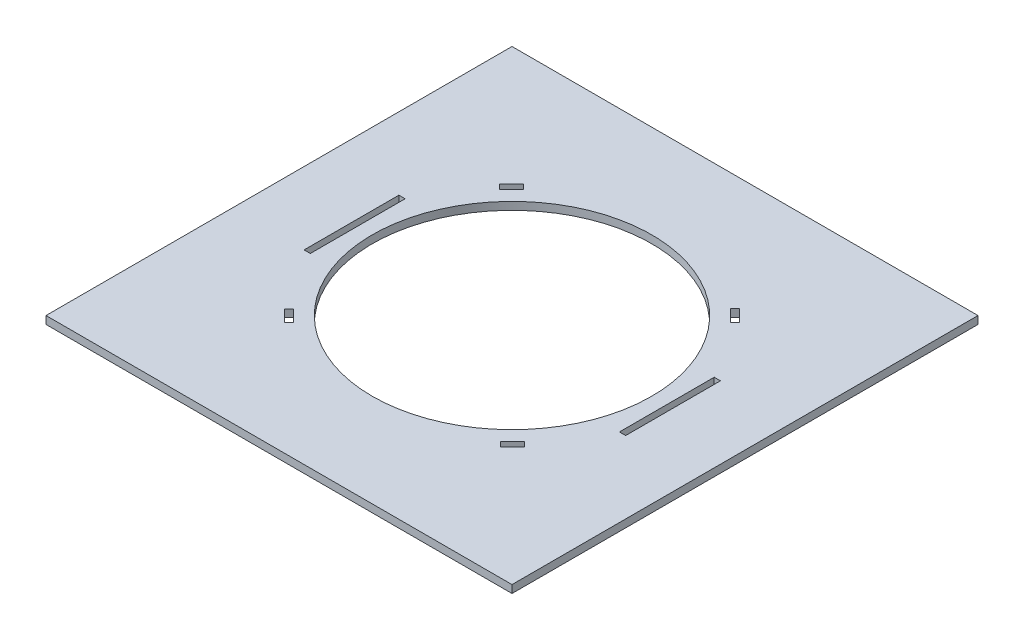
ISO-10303-21;
HEADER;
FILE_DESCRIPTION(('STEP AP214'),'2;1');
FILE_NAME('part.step','',(''),(''),'','','');
FILE_SCHEMA(('AUTOMOTIVE_DESIGN { 1 0 10303 214 1 1 1 1 }'));
ENDSEC;
DATA;
#1=APPLICATION_CONTEXT('core data for automotive mechanical design processes');
#2=APPLICATION_PROTOCOL_DEFINITION('international standard','automotive_design',2000,#1);
#3=PRODUCT_CONTEXT('',#1,'mechanical');
#4=PRODUCT('Part','Part','',(#3));
#5=PRODUCT_RELATED_PRODUCT_CATEGORY('part','',(#4));
#6=PRODUCT_DEFINITION_FORMATION('','',#4);
#7=PRODUCT_DEFINITION_CONTEXT('part definition',#1,'design');
#8=PRODUCT_DEFINITION('design','',#6,#7);
#9=PRODUCT_DEFINITION_SHAPE('','',#8);
#10=(LENGTH_UNIT() NAMED_UNIT(*) SI_UNIT(.MILLI.,.METRE.));
#11=(NAMED_UNIT(*) PLANE_ANGLE_UNIT() SI_UNIT($,.RADIAN.));
#12=(NAMED_UNIT(*) SI_UNIT($,.STERADIAN.) SOLID_ANGLE_UNIT());
#13=UNCERTAINTY_MEASURE_WITH_UNIT(LENGTH_MEASURE(1.E-05),#10,'distance_accuracy_value','');
#14=(GEOMETRIC_REPRESENTATION_CONTEXT(3) GLOBAL_UNCERTAINTY_ASSIGNED_CONTEXT((#13)) GLOBAL_UNIT_ASSIGNED_CONTEXT((#10,
#11,#12)) REPRESENTATION_CONTEXT('',''));
#15=CARTESIAN_POINT('',(0.,0.,0.));
#16=DIRECTION('',(0.,0.,1.));
#17=DIRECTION('',(1.,0.,0.));
#18=AXIS2_PLACEMENT_3D('',#15,#16,#17);
#19=CARTESIAN_POINT('',(0.,5.,0.));
#20=DIRECTION('',(0.,1.,0.));
#21=DIRECTION('',(0.,0.,1.));
#22=AXIS2_PLACEMENT_3D('',#19,#20,#21);
#23=PLANE('',#22);
#24=CARTESIAN_POINT('',(-77.2123238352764,5.,-69.1700935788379));
#25=CARTESIAN_POINT('',(-74.3725830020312,5.,-66.3303527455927));
#26=B_SPLINE_CURVE_WITH_KNOTS('',1,(#24,#25),.UNSPECIFIED.,.F.,.F.,(2,2),(0.,0.133581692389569),.UNSPECIFIED.);
#27=CARTESIAN_POINT('',(-77.2123238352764,5.,-69.1700935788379));
#28=VERTEX_POINT('',#27);
#29=CARTESIAN_POINT('',(-74.3725830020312,5.,-66.3303527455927));
#30=VERTEX_POINT('',#29);
#31=EDGE_CURVE('E277',#28,#30,#26,.T.);
#32=ORIENTED_EDGE('',*,*,#31,.F.);
#33=CARTESIAN_POINT('',(-69.4228355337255,5.,-76.9595818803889));
#34=CARTESIAN_POINT('',(-77.2123238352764,5.,-69.1700935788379));
#35=B_SPLINE_CURVE_WITH_KNOTS('',1,(#33,#34),.UNSPECIFIED.,.F.,.F.,(2,2),(0.633581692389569,1.),.UNSPECIFIED.);
#36=CARTESIAN_POINT('',(-69.4228355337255,5.,-76.9595818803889));
#37=VERTEX_POINT('',#36);
#38=EDGE_CURVE('E350',#37,#28,#35,.T.);
#39=ORIENTED_EDGE('',*,*,#38,.F.);
#40=CARTESIAN_POINT('',(-66.5830947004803,5.,-74.1198410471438));
#41=CARTESIAN_POINT('',(-69.4228355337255,5.,-76.9595818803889));
#42=B_SPLINE_CURVE_WITH_KNOTS('',1,(#40,#41),.UNSPECIFIED.,.F.,.F.,(2,2),(0.5,
0.633581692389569),.UNSPECIFIED.);
#43=CARTESIAN_POINT('',(-66.5830947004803,5.,-74.1198410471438));
#44=VERTEX_POINT('',#43);
#45=EDGE_CURVE('E342',#44,#37,#42,.T.);
#46=ORIENTED_EDGE('',*,*,#45,.F.);
#47=CARTESIAN_POINT('',(-74.3725830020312,5.,-66.3303527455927));
#48=CARTESIAN_POINT('',(-66.5830947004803,5.,-74.1198410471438));
#49=B_SPLINE_CURVE_WITH_KNOTS('',1,(#47,#48),.UNSPECIFIED.,.F.,.F.,(2,2),(0.133581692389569,
0.5),.UNSPECIFIED.);
#50=EDGE_CURVE('E334',#30,#44,#49,.T.);
#51=ORIENTED_EDGE('',*,*,#50,.F.);
#52=EDGE_LOOP('',(#32,#39,#46,#51));
#53=FACE_BOUND('',#52,.T.);
#54=CARTESIAN_POINT('',(69.1700935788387,5.,-77.2123238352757));
#55=CARTESIAN_POINT('',(66.3303527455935,5.,-74.3725830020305));
#56=B_SPLINE_CURVE_WITH_KNOTS('',1,(#54,#55),.UNSPECIFIED.,.F.,.F.,(2,2),(0.,0.133581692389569),.UNSPECIFIED.);
#57=CARTESIAN_POINT('',(69.1700935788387,5.,-77.2123238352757));
#58=VERTEX_POINT('',#57);
#59=CARTESIAN_POINT('',(66.3303527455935,5.,-74.3725830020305));
#60=VERTEX_POINT('',#59);
#61=EDGE_CURVE('E370',#58,#60,#56,.T.);
#62=ORIENTED_EDGE('',*,*,#61,.F.);
#63=CARTESIAN_POINT('',(76.9595818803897,5.,-69.4228355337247));
#64=CARTESIAN_POINT('',(69.1700935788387,5.,-77.2123238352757));
#65=B_SPLINE_CURVE_WITH_KNOTS('',1,(#63,#64),.UNSPECIFIED.,.F.,.F.,(2,2),(0.633581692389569,1.),.UNSPECIFIED.);
#66=CARTESIAN_POINT('',(76.9595818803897,5.,-69.4228355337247));
#67=VERTEX_POINT('',#66);
#68=EDGE_CURVE('E399',#67,#58,#65,.T.);
#69=ORIENTED_EDGE('',*,*,#68,.F.);
#70=CARTESIAN_POINT('',(74.1198410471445,5.,-66.5830947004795));
#71=CARTESIAN_POINT('',(76.9595818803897,5.,-69.4228355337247));
#72=B_SPLINE_CURVE_WITH_KNOTS('',1,(#70,#71),.UNSPECIFIED.,.F.,.F.,(2,2),(0.5,
0.633581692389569),.UNSPECIFIED.);
#73=CARTESIAN_POINT('',(74.1198410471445,5.,-66.5830947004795));
#74=VERTEX_POINT('',#73);
#75=EDGE_CURVE('E391',#74,#67,#72,.T.);
#76=ORIENTED_EDGE('',*,*,#75,.F.);
#77=CARTESIAN_POINT('',(66.3303527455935,5.,-74.3725830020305));
#78=CARTESIAN_POINT('',(74.1198410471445,5.,-66.5830947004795));
#79=B_SPLINE_CURVE_WITH_KNOTS('',1,(#77,#78),.UNSPECIFIED.,.F.,.F.,(2,2),(0.133581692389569,
0.5),.UNSPECIFIED.);
#80=EDGE_CURVE('E383',#60,#74,#79,.T.);
#81=ORIENTED_EDGE('',*,*,#80,.F.);
#82=EDGE_LOOP('',(#62,#69,#76,#81));
#83=FACE_BOUND('',#82,.T.);
#84=CARTESIAN_POINT('',(77.2123238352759,5.,69.1700935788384));
#85=CARTESIAN_POINT('',(74.3725830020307,5.,66.3303527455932));
#86=B_SPLINE_CURVE_WITH_KNOTS('',1,(#84,#85),.UNSPECIFIED.,.F.,.F.,(2,2),(0.,0.133581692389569),.UNSPECIFIED.);
#87=CARTESIAN_POINT('',(77.2123238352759,5.,69.1700935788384));
#88=VERTEX_POINT('',#87);
#89=CARTESIAN_POINT('',(74.3725830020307,5.,66.3303527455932));
#90=VERTEX_POINT('',#89);
#91=EDGE_CURVE('E419',#88,#90,#86,.T.);
#92=ORIENTED_EDGE('',*,*,#91,.F.);
#93=CARTESIAN_POINT('',(69.4228355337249,5.,76.9595818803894));
#94=CARTESIAN_POINT('',(77.2123238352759,5.,69.1700935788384));
#95=B_SPLINE_CURVE_WITH_KNOTS('',1,(#93,#94),.UNSPECIFIED.,.F.,.F.,(2,2),(0.633581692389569,1.),.UNSPECIFIED.);
#96=CARTESIAN_POINT('',(69.4228355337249,5.,76.9595818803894));
#97=VERTEX_POINT('',#96);
#98=EDGE_CURVE('E448',#97,#88,#95,.T.);
#99=ORIENTED_EDGE('',*,*,#98,.F.);
#100=CARTESIAN_POINT('',(66.5830947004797,5.,74.1198410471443));
#101=CARTESIAN_POINT('',(69.4228355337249,5.,76.9595818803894));
#102=B_SPLINE_CURVE_WITH_KNOTS('',1,(#100,#101),.UNSPECIFIED.,.F.,.F.,(2,2),(0.5,
0.633581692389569),.UNSPECIFIED.);
#103=CARTESIAN_POINT('',(66.5830947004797,5.,74.1198410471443));
#104=VERTEX_POINT('',#103);
#105=EDGE_CURVE('E440',#104,#97,#102,.T.);
#106=ORIENTED_EDGE('',*,*,#105,.F.);
#107=CARTESIAN_POINT('',(74.3725830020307,5.,66.3303527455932));
#108=CARTESIAN_POINT('',(66.5830947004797,5.,74.1198410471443));
#109=B_SPLINE_CURVE_WITH_KNOTS('',1,(#107,#108),.UNSPECIFIED.,.F.,.F.,(2,2),(0.133581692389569,
0.5),.UNSPECIFIED.);
#110=EDGE_CURVE('E432',#90,#104,#109,.T.);
#111=ORIENTED_EDGE('',*,*,#110,.F.);
#112=EDGE_LOOP('',(#92,#99,#106,#111));
#113=FACE_BOUND('',#112,.T.);
#114=CARTESIAN_POINT('',(-69.1700935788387,5.,77.2123238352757));
#115=CARTESIAN_POINT('',(-66.3303527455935,5.,74.3725830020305));
#116=B_SPLINE_CURVE_WITH_KNOTS('',1,(#114,#115),.UNSPECIFIED.,.F.,.F.,(2,2),(0.,
0.133581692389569),.UNSPECIFIED.);
#117=CARTESIAN_POINT('',(-69.1700935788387,5.,77.2123238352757));
#118=VERTEX_POINT('',#117);
#119=CARTESIAN_POINT('',(-66.3303527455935,5.,74.3725830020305));
#120=VERTEX_POINT('',#119);
#121=EDGE_CURVE('E468',#118,#120,#116,.T.);
#122=ORIENTED_EDGE('',*,*,#121,.F.);
#123=CARTESIAN_POINT('',(-76.9595818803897,5.,69.4228355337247));
#124=CARTESIAN_POINT('',(-69.1700935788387,5.,77.2123238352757));
#125=B_SPLINE_CURVE_WITH_KNOTS('',1,(#123,#124),.UNSPECIFIED.,.F.,.F.,(2,2),(0.633581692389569,
1.),.UNSPECIFIED.);
#126=CARTESIAN_POINT('',(-76.9595818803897,5.,69.4228355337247));
#127=VERTEX_POINT('',#126);
#128=EDGE_CURVE('E497',#127,#118,#125,.T.);
#129=ORIENTED_EDGE('',*,*,#128,.F.);
#130=CARTESIAN_POINT('',(-74.1198410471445,5.,66.5830947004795));
#131=CARTESIAN_POINT('',(-76.9595818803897,5.,69.4228355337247));
#132=B_SPLINE_CURVE_WITH_KNOTS('',1,(#130,#131),.UNSPECIFIED.,.F.,.F.,(2,2),(0.5,
0.633581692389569),.UNSPECIFIED.);
#133=CARTESIAN_POINT('',(-74.1198410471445,5.,66.5830947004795));
#134=VERTEX_POINT('',#133);
#135=EDGE_CURVE('E489',#134,#127,#132,.T.);
#136=ORIENTED_EDGE('',*,*,#135,.F.);
#137=CARTESIAN_POINT('',(-66.3303527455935,5.,74.3725830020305));
#138=CARTESIAN_POINT('',(-74.1198410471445,5.,66.5830947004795));
#139=B_SPLINE_CURVE_WITH_KNOTS('',1,(#137,#138),.UNSPECIFIED.,.F.,.F.,(2,2),(0.133581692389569,
0.5),.UNSPECIFIED.);
#140=EDGE_CURVE('E481',#120,#134,#139,.T.);
#141=ORIENTED_EDGE('',*,*,#140,.F.);
#142=EDGE_LOOP('',(#122,#129,#136,#141));
#143=FACE_BOUND('',#142,.T.);
#144=DIRECTION('',(0.,0.,1.));
#145=VECTOR('',#144,1.);
#146=CARTESIAN_POINT('',(-150.,5.,-150.));
#147=LINE('',#146,#145);
#148=CARTESIAN_POINT('',(-150.,5.,-150.));
#149=VERTEX_POINT('',#148);
#150=CARTESIAN_POINT('',(-150.,5.,150.));
#151=VERTEX_POINT('',#150);
#152=EDGE_CURVE('E524',#149,#151,#147,.T.);
#153=ORIENTED_EDGE('',*,*,#152,.T.);
#154=DIRECTION('',(1.,0.,0.));
#155=VECTOR('',#154,1.);
#156=CARTESIAN_POINT('',(-150.,5.,150.));
#157=LINE('',#156,#155);
#158=CARTESIAN_POINT('',(150.,5.,150.));
#159=VERTEX_POINT('',#158);
#160=EDGE_CURVE('E527',#151,#159,#157,.T.);
#161=ORIENTED_EDGE('',*,*,#160,.T.);
#162=DIRECTION('',(0.,0.,-1.));
#163=VECTOR('',#162,1.);
#164=CARTESIAN_POINT('',(150.,5.,-150.));
#165=LINE('',#164,#163);
#166=CARTESIAN_POINT('',(150.,5.,-150.));
#167=VERTEX_POINT('',#166);
#168=EDGE_CURVE('E530',#159,#167,#165,.T.);
#169=ORIENTED_EDGE('',*,*,#168,.T.);
#170=DIRECTION('',(-1.,0.,0.));
#171=VECTOR('',#170,1.);
#172=CARTESIAN_POINT('',(-150.,5.,-150.));
#173=LINE('',#172,#171);
#174=EDGE_CURVE('E532',#167,#149,#173,.T.);
#175=ORIENTED_EDGE('',*,*,#174,.T.);
#176=EDGE_LOOP('',(#153,#161,#169,#175));
#177=FACE_BOUND('',#176,.T.);
#178=CARTESIAN_POINT('',(0.,5.,0.));
#179=DIRECTION('',(0.,1.,0.));
#180=DIRECTION('',(0.,0.,1.));
#181=AXIS2_PLACEMENT_3D('',#178,#179,#180);
#182=CIRCLE('',#181,90.);
#183=CARTESIAN_POINT('',(0.,5.,90.));
#184=VERTEX_POINT('',#183);
#185=EDGE_CURVE('E518',#184,#184,#182,.T.);
#186=ORIENTED_EDGE('',*,*,#185,.F.);
#187=EDGE_LOOP('',(#186));
#188=FACE_BOUND('',#187,.T.);
#189=CARTESIAN_POINT('',(-99.492,5.,30.3292844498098));
#190=CARTESIAN_POINT('',(-103.508,5.,30.3292844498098));
#191=B_SPLINE_CURVE_WITH_KNOTS('',1,(#189,#190),.UNSPECIFIED.,.F.,.F.,(2,2),(0.5,
0.530877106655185),.UNSPECIFIED.);
#192=CARTESIAN_POINT('',(-99.492,5.,30.3292844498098));
#193=VERTEX_POINT('',#192);
#194=CARTESIAN_POINT('',(-103.508,5.,30.3292844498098));
#195=VERTEX_POINT('',#194);
#196=EDGE_CURVE('E292',#193,#195,#191,.T.);
#197=ORIENTED_EDGE('',*,*,#196,.T.);
#198=CARTESIAN_POINT('',(-103.508,5.,30.3292844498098));
#199=CARTESIAN_POINT('',(-103.508,5.,-30.6867155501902));
#200=B_SPLINE_CURVE_WITH_KNOTS('',1,(#198,#199),.UNSPECIFIED.,.F.,.F.,(2,2),(0.530877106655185,
1.),.UNSPECIFIED.);
#201=CARTESIAN_POINT('',(-103.508,5.,-30.6867155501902));
#202=VERTEX_POINT('',#201);
#203=EDGE_CURVE('E300',#195,#202,#200,.T.);
#204=ORIENTED_EDGE('',*,*,#203,.T.);
#205=CARTESIAN_POINT('',(-103.508,5.,-30.6867155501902));
#206=CARTESIAN_POINT('',(-99.492,5.,-30.6867155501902));
#207=B_SPLINE_CURVE_WITH_KNOTS('',1,(#205,#206),.UNSPECIFIED.,.F.,.F.,(2,2),(0.,
0.0308771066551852),.UNSPECIFIED.);
#208=CARTESIAN_POINT('',(-99.492,5.,-30.6867155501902));
#209=VERTEX_POINT('',#208);
#210=EDGE_CURVE('E278',#202,#209,#207,.T.);
#211=ORIENTED_EDGE('',*,*,#210,.T.);
#212=CARTESIAN_POINT('',(-99.492,5.,-30.6867155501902));
#213=CARTESIAN_POINT('',(-99.492,5.,30.3292844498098));
#214=B_SPLINE_CURVE_WITH_KNOTS('',1,(#212,#213),.UNSPECIFIED.,.F.,.F.,(2,2),(0.0308771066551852,
0.5),.UNSPECIFIED.);
#215=EDGE_CURVE('E283',#209,#193,#214,.T.);
#216=ORIENTED_EDGE('',*,*,#215,.T.);
#217=EDGE_LOOP('',(#197,#204,#211,#216));
#218=FACE_BOUND('',#217,.T.);
#219=CARTESIAN_POINT('',(103.508,5.,-30.6867155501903));
#220=CARTESIAN_POINT('',(99.492,5.,-30.6867155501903));
#221=B_SPLINE_CURVE_WITH_KNOTS('',1,(#219,#220),.UNSPECIFIED.,.F.,.F.,(2,2),(0.,
0.0308771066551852),.UNSPECIFIED.);
#222=CARTESIAN_POINT('',(103.508,5.,-30.6867155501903));
#223=VERTEX_POINT('',#222);
#224=CARTESIAN_POINT('',(99.492,5.,-30.6867155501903));
#225=VERTEX_POINT('',#224);
#226=EDGE_CURVE('E232',#223,#225,#221,.T.);
#227=ORIENTED_EDGE('',*,*,#226,.F.);
#228=CARTESIAN_POINT('',(103.508,5.,30.3292844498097));
#229=CARTESIAN_POINT('',(103.508,5.,-30.6867155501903));
#230=B_SPLINE_CURVE_WITH_KNOTS('',1,(#228,#229),.UNSPECIFIED.,.F.,.F.,(2,2),(0.530877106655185,
1.),.UNSPECIFIED.);
#231=CARTESIAN_POINT('',(103.508,5.,30.3292844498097));
#232=VERTEX_POINT('',#231);
#233=EDGE_CURVE('E50',#232,#223,#230,.T.);
#234=ORIENTED_EDGE('',*,*,#233,.F.);
#235=CARTESIAN_POINT('',(99.492,5.,30.3292844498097));
#236=CARTESIAN_POINT('',(103.508,5.,30.3292844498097));
#237=B_SPLINE_CURVE_WITH_KNOTS('',1,(#235,#236),.UNSPECIFIED.,.F.,.F.,(2,2),(0.5,
0.530877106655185),.UNSPECIFIED.);
#238=CARTESIAN_POINT('',(99.492,5.,30.3292844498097));
#239=VERTEX_POINT('',#238);
#240=EDGE_CURVE('E238',#239,#232,#237,.T.);
#241=ORIENTED_EDGE('',*,*,#240,.F.);
#242=CARTESIAN_POINT('',(99.492,5.,-30.6867155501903));
#243=CARTESIAN_POINT('',(99.492,5.,30.3292844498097));
#244=B_SPLINE_CURVE_WITH_KNOTS('',1,(#242,#243),.UNSPECIFIED.,.F.,.F.,(2,2),(0.0308771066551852,
0.5),.UNSPECIFIED.);
#245=EDGE_CURVE('E223',#225,#239,#244,.T.);
#246=ORIENTED_EDGE('',*,*,#245,.F.);
#247=EDGE_LOOP('',(#227,#234,#241,#246));
#248=FACE_BOUND('',#247,.T.);
#249=ADVANCED_FACE('F35',(#53,#83,#113,#143,#177,#188,#218,#248),#23,.T.);
#250=CARTESIAN_POINT('',(0.,0.,0.));
#251=DIRECTION('',(0.,1.,0.));
#252=DIRECTION('',(0.,0.,1.));
#253=AXIS2_PLACEMENT_3D('',#250,#251,#252);
#254=PLANE('',#253);
#255=DIRECTION('',(0.,0.,1.));
#256=VECTOR('',#255,1.);
#257=CARTESIAN_POINT('',(-103.508,0.,30.3292844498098));
#258=LINE('',#257,#256);
#259=CARTESIAN_POINT('',(-103.508,0.,-30.6867155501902));
#260=VERTEX_POINT('',#259);
#261=CARTESIAN_POINT('',(-103.508,0.,30.3292844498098));
#262=VERTEX_POINT('',#261);
#263=EDGE_CURVE('E271',#260,#262,#258,.T.);
#264=ORIENTED_EDGE('',*,*,#263,.T.);
#265=DIRECTION('',(1.,0.,0.));
#266=VECTOR('',#265,1.);
#267=CARTESIAN_POINT('',(-99.492,0.,30.3292844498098));
#268=LINE('',#267,#266);
#269=CARTESIAN_POINT('',(-99.492,0.,30.3292844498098));
#270=VERTEX_POINT('',#269);
#271=EDGE_CURVE('E267',#262,#270,#268,.T.);
#272=ORIENTED_EDGE('',*,*,#271,.T.);
#273=DIRECTION('',(0.,0.,-1.));
#274=VECTOR('',#273,1.);
#275=CARTESIAN_POINT('',(-99.492,0.,-30.6867155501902));
#276=LINE('',#275,#274);
#277=CARTESIAN_POINT('',(-99.492,0.,-30.6867155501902));
#278=VERTEX_POINT('',#277);
#279=EDGE_CURVE('E270',#270,#278,#276,.T.);
#280=ORIENTED_EDGE('',*,*,#279,.T.);
#281=DIRECTION('',(-1.,0.,0.));
#282=VECTOR('',#281,1.);
#283=CARTESIAN_POINT('',(-103.508,0.,-30.6867155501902));
#284=LINE('',#283,#282);
#285=EDGE_CURVE('E274',#278,#260,#284,.T.);
#286=ORIENTED_EDGE('',*,*,#285,.T.);
#287=EDGE_LOOP('',(#264,#272,#280,#286));
#288=FACE_BOUND('',#287,.T.);
#289=DIRECTION('',(0.70710678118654,0.,-0.707106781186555));
#290=VECTOR('',#289,1.);
#291=CARTESIAN_POINT('',(-69.4228355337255,0.,-76.9595818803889));
#292=LINE('',#291,#290);
#293=CARTESIAN_POINT('',(-77.2123238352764,0.,-69.1700935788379));
#294=VERTEX_POINT('',#293);
#295=CARTESIAN_POINT('',(-69.4228355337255,0.,-76.9595818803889));
#296=VERTEX_POINT('',#295);
#297=EDGE_CURVE('E325',#294,#296,#292,.T.);
#298=ORIENTED_EDGE('',*,*,#297,.F.);
#299=DIRECTION('',(-0.707106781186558,0.,-0.707106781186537));
#300=VECTOR('',#299,1.);
#301=CARTESIAN_POINT('',(-77.2123238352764,0.,-69.1700935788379));
#302=LINE('',#301,#300);
#303=CARTESIAN_POINT('',(-74.3725830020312,0.,-66.3303527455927));
#304=VERTEX_POINT('',#303);
#305=EDGE_CURVE('E328',#304,#294,#302,.T.);
#306=ORIENTED_EDGE('',*,*,#305,.F.);
#307=DIRECTION('',(-0.70710678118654,0.,0.707106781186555));
#308=VECTOR('',#307,1.);
#309=CARTESIAN_POINT('',(-74.3725830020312,0.,-66.3303527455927));
#310=LINE('',#309,#308);
#311=CARTESIAN_POINT('',(-66.5830947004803,0.,-74.1198410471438));
#312=VERTEX_POINT('',#311);
#313=EDGE_CURVE('E330',#312,#304,#310,.T.);
#314=ORIENTED_EDGE('',*,*,#313,.F.);
#315=DIRECTION('',(0.707106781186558,0.,0.707106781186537));
#316=VECTOR('',#315,1.);
#317=CARTESIAN_POINT('',(-66.5830947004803,0.,-74.1198410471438));
#318=LINE('',#317,#316);
#319=EDGE_CURVE('E322',#296,#312,#318,.T.);
#320=ORIENTED_EDGE('',*,*,#319,.F.);
#321=EDGE_LOOP('',(#298,#306,#314,#320));
#322=FACE_BOUND('',#321,.T.);
#323=DIRECTION('',(0.707106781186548,0.,0.707106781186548));
#324=VECTOR('',#323,1.);
#325=CARTESIAN_POINT('',(76.9595818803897,0.,-69.4228355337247));
#326=LINE('',#325,#324);
#327=CARTESIAN_POINT('',(69.1700935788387,0.,-77.2123238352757));
#328=VERTEX_POINT('',#327);
#329=CARTESIAN_POINT('',(76.9595818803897,0.,-69.4228355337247));
#330=VERTEX_POINT('',#329);
#331=EDGE_CURVE('E374',#328,#330,#326,.T.);
#332=ORIENTED_EDGE('',*,*,#331,.F.);
#333=DIRECTION('',(0.707106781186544,0.,-0.707106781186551));
#334=VECTOR('',#333,1.);
#335=CARTESIAN_POINT('',(69.1700935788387,0.,-77.2123238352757));
#336=LINE('',#335,#334);
#337=CARTESIAN_POINT('',(66.3303527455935,0.,-74.3725830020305));
#338=VERTEX_POINT('',#337);
#339=EDGE_CURVE('E377',#338,#328,#336,.T.);
#340=ORIENTED_EDGE('',*,*,#339,.F.);
#341=DIRECTION('',(-0.707106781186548,0.,-0.707106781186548));
#342=VECTOR('',#341,1.);
#343=CARTESIAN_POINT('',(66.3303527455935,0.,-74.3725830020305));
#344=LINE('',#343,#342);
#345=CARTESIAN_POINT('',(74.1198410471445,0.,-66.5830947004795));
#346=VERTEX_POINT('',#345);
#347=EDGE_CURVE('E379',#346,#338,#344,.T.);
#348=ORIENTED_EDGE('',*,*,#347,.F.);
#349=DIRECTION('',(-0.707106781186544,0.,0.707106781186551));
#350=VECTOR('',#349,1.);
#351=CARTESIAN_POINT('',(74.1198410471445,0.,-66.5830947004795));
#352=LINE('',#351,#350);
#353=EDGE_CURVE('E371',#330,#346,#352,.T.);
#354=ORIENTED_EDGE('',*,*,#353,.F.);
#355=EDGE_LOOP('',(#332,#340,#348,#354));
#356=FACE_BOUND('',#355,.T.);
#357=DIRECTION('',(-0.707106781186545,0.,0.70710678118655));
#358=VECTOR('',#357,1.);
#359=CARTESIAN_POINT('',(69.4228355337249,0.,76.9595818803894));
#360=LINE('',#359,#358);
#361=CARTESIAN_POINT('',(77.2123238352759,0.,69.1700935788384));
#362=VERTEX_POINT('',#361);
#363=CARTESIAN_POINT('',(69.4228355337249,0.,76.9595818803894));
#364=VERTEX_POINT('',#363);
#365=EDGE_CURVE('E423',#362,#364,#360,.T.);
#366=ORIENTED_EDGE('',*,*,#365,.F.);
#367=DIRECTION('',(0.707106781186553,0.,0.707106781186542));
#368=VECTOR('',#367,1.);
#369=CARTESIAN_POINT('',(77.2123238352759,0.,69.1700935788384));
#370=LINE('',#369,#368);
#371=CARTESIAN_POINT('',(74.3725830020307,0.,66.3303527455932));
#372=VERTEX_POINT('',#371);
#373=EDGE_CURVE('E426',#372,#362,#370,.T.);
#374=ORIENTED_EDGE('',*,*,#373,.F.);
#375=DIRECTION('',(0.707106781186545,0.,-0.70710678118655));
#376=VECTOR('',#375,1.);
#377=CARTESIAN_POINT('',(74.3725830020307,0.,66.3303527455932));
#378=LINE('',#377,#376);
#379=CARTESIAN_POINT('',(66.5830947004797,0.,74.1198410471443));
#380=VERTEX_POINT('',#379);
#381=EDGE_CURVE('E428',#380,#372,#378,.T.);
#382=ORIENTED_EDGE('',*,*,#381,.F.);
#383=DIRECTION('',(-0.707106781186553,0.,-0.707106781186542));
#384=VECTOR('',#383,1.);
#385=CARTESIAN_POINT('',(66.5830947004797,0.,74.1198410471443));
#386=LINE('',#385,#384);
#387=EDGE_CURVE('E420',#364,#380,#386,.T.);
#388=ORIENTED_EDGE('',*,*,#387,.F.);
#389=EDGE_LOOP('',(#366,#374,#382,#388));
#390=FACE_BOUND('',#389,.T.);
#391=DIRECTION('',(-0.707106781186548,0.,-0.707106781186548));
#392=VECTOR('',#391,1.);
#393=CARTESIAN_POINT('',(-76.9595818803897,0.,69.4228355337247));
#394=LINE('',#393,#392);
#395=CARTESIAN_POINT('',(-69.1700935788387,0.,77.2123238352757));
#396=VERTEX_POINT('',#395);
#397=CARTESIAN_POINT('',(-76.9595818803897,0.,69.4228355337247));
#398=VERTEX_POINT('',#397);
#399=EDGE_CURVE('E472',#396,#398,#394,.T.);
#400=ORIENTED_EDGE('',*,*,#399,.F.);
#401=DIRECTION('',(-0.707106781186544,0.,0.707106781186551));
#402=VECTOR('',#401,1.);
#403=CARTESIAN_POINT('',(-69.1700935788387,0.,77.2123238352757));
#404=LINE('',#403,#402);
#405=CARTESIAN_POINT('',(-66.3303527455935,0.,74.3725830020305));
#406=VERTEX_POINT('',#405);
#407=EDGE_CURVE('E475',#406,#396,#404,.T.);
#408=ORIENTED_EDGE('',*,*,#407,.F.);
#409=DIRECTION('',(0.707106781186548,0.,0.707106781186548));
#410=VECTOR('',#409,1.);
#411=CARTESIAN_POINT('',(-66.3303527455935,0.,74.3725830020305));
#412=LINE('',#411,#410);
#413=CARTESIAN_POINT('',(-74.1198410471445,0.,66.5830947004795));
#414=VERTEX_POINT('',#413);
#415=EDGE_CURVE('E477',#414,#406,#412,.T.);
#416=ORIENTED_EDGE('',*,*,#415,.F.);
#417=DIRECTION('',(0.707106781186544,0.,-0.707106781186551));
#418=VECTOR('',#417,1.);
#419=CARTESIAN_POINT('',(-74.1198410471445,0.,66.5830947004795));
#420=LINE('',#419,#418);
#421=EDGE_CURVE('E469',#398,#414,#420,.T.);
#422=ORIENTED_EDGE('',*,*,#421,.F.);
#423=EDGE_LOOP('',(#400,#408,#416,#422));
#424=FACE_BOUND('',#423,.T.);
#425=DIRECTION('',(0.,0.,1.));
#426=VECTOR('',#425,1.);
#427=CARTESIAN_POINT('',(-150.,0.,-150.));
#428=LINE('',#427,#426);
#429=CARTESIAN_POINT('',(-150.,0.,-150.));
#430=VERTEX_POINT('',#429);
#431=CARTESIAN_POINT('',(-150.,0.,150.));
#432=VERTEX_POINT('',#431);
#433=EDGE_CURVE('E521',#430,#432,#428,.T.);
#434=ORIENTED_EDGE('',*,*,#433,.F.);
#435=DIRECTION('',(-1.,0.,0.));
#436=VECTOR('',#435,1.);
#437=CARTESIAN_POINT('',(-150.,0.,-150.));
#438=LINE('',#437,#436);
#439=CARTESIAN_POINT('',(150.,0.,-150.));
#440=VERTEX_POINT('',#439);
#441=EDGE_CURVE('E528',#440,#430,#438,.T.);
#442=ORIENTED_EDGE('',*,*,#441,.F.);
#443=DIRECTION('',(0.,0.,-1.));
#444=VECTOR('',#443,1.);
#445=CARTESIAN_POINT('',(150.,0.,-150.));
#446=LINE('',#445,#444);
#447=CARTESIAN_POINT('',(150.,0.,150.));
#448=VERTEX_POINT('',#447);
#449=EDGE_CURVE('E539',#448,#440,#446,.T.);
#450=ORIENTED_EDGE('',*,*,#449,.F.);
#451=DIRECTION('',(1.,0.,0.));
#452=VECTOR('',#451,1.);
#453=CARTESIAN_POINT('',(-150.,0.,150.));
#454=LINE('',#453,#452);
#455=EDGE_CURVE('E537',#432,#448,#454,.T.);
#456=ORIENTED_EDGE('',*,*,#455,.F.);
#457=EDGE_LOOP('',(#434,#442,#450,#456));
#458=FACE_BOUND('',#457,.T.);
#459=CARTESIAN_POINT('',(0.,0.,0.));
#460=DIRECTION('',(0.,1.,0.));
#461=DIRECTION('',(0.,0.,1.));
#462=AXIS2_PLACEMENT_3D('',#459,#460,#461);
#463=CIRCLE('',#462,90.);
#464=CARTESIAN_POINT('',(0.,0.,90.));
#465=VERTEX_POINT('',#464);
#466=EDGE_CURVE('E517',#465,#465,#463,.T.);
#467=ORIENTED_EDGE('',*,*,#466,.T.);
#468=EDGE_LOOP('',(#467));
#469=FACE_BOUND('',#468,.T.);
#470=DIRECTION('',(0.,0.,1.));
#471=VECTOR('',#470,1.);
#472=CARTESIAN_POINT('',(103.508,0.,30.3292844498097));
#473=LINE('',#472,#471);
#474=CARTESIAN_POINT('',(103.508,0.,-30.6867155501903));
#475=VERTEX_POINT('',#474);
#476=CARTESIAN_POINT('',(103.508,0.,30.3292844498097));
#477=VERTEX_POINT('',#476);
#478=EDGE_CURVE('E228',#475,#477,#473,.T.);
#479=ORIENTED_EDGE('',*,*,#478,.F.);
#480=DIRECTION('',(1.,0.,0.));
#481=VECTOR('',#480,1.);
#482=CARTESIAN_POINT('',(103.508,0.,-30.6867155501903));
#483=LINE('',#482,#481);
#484=CARTESIAN_POINT('',(99.492,0.,-30.6867155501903));
#485=VERTEX_POINT('',#484);
#486=EDGE_CURVE('E284',#485,#475,#483,.T.);
#487=ORIENTED_EDGE('',*,*,#486,.F.);
#488=DIRECTION('',(0.,0.,-1.));
#489=VECTOR('',#488,1.);
#490=CARTESIAN_POINT('',(99.492,0.,-30.6867155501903));
#491=LINE('',#490,#489);
#492=CARTESIAN_POINT('',(99.492,0.,30.3292844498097));
#493=VERTEX_POINT('',#492);
#494=EDGE_CURVE('E226',#493,#485,#491,.T.);
#495=ORIENTED_EDGE('',*,*,#494,.F.);
#496=DIRECTION('',(-1.,0.,0.));
#497=VECTOR('',#496,1.);
#498=CARTESIAN_POINT('',(99.492,0.,30.3292844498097));
#499=LINE('',#498,#497);
#500=EDGE_CURVE('E266',#477,#493,#499,.T.);
#501=ORIENTED_EDGE('',*,*,#500,.F.);
#502=EDGE_LOOP('',(#479,#487,#495,#501));
#503=FACE_BOUND('',#502,.T.);
#504=ADVANCED_FACE('F557',(#288,#322,#356,#390,#424,#458,#469,#503),#254,.F.);
#505=CARTESIAN_POINT('',(-150.,5.,-150.));
#506=DIRECTION('',(1.,0.,0.));
#507=DIRECTION('',(0.,0.,-1.));
#508=AXIS2_PLACEMENT_3D('',#505,#506,#507);
#509=PLANE('',#508);
#510=ORIENTED_EDGE('',*,*,#433,.T.);
#511=DIRECTION('',(0.,-1.,0.));
#512=VECTOR('',#511,1.);
#513=CARTESIAN_POINT('',(-150.,5.,150.));
#514=LINE('',#513,#512);
#515=EDGE_CURVE('E11',#151,#432,#514,.T.);
#516=ORIENTED_EDGE('',*,*,#515,.F.);
#517=ORIENTED_EDGE('',*,*,#152,.F.);
#518=DIRECTION('',(0.,-1.,0.));
#519=VECTOR('',#518,1.);
#520=CARTESIAN_POINT('',(-150.,5.,-150.));
#521=LINE('',#520,#519);
#522=EDGE_CURVE('E534',#149,#430,#521,.T.);
#523=ORIENTED_EDGE('',*,*,#522,.T.);
#524=EDGE_LOOP('',(#510,#516,#517,#523));
#525=FACE_BOUND('',#524,.T.);
#526=ADVANCED_FACE('F37',(#525),#509,.F.);
#527=CARTESIAN_POINT('',(-150.,5.,150.));
#528=DIRECTION('',(0.,0.,-1.));
#529=DIRECTION('',(-1.,0.,0.));
#530=AXIS2_PLACEMENT_3D('',#527,#528,#529);
#531=PLANE('',#530);
#532=ORIENTED_EDGE('',*,*,#455,.T.);
#533=DIRECTION('',(0.,-1.,0.));
#534=VECTOR('',#533,1.);
#535=CARTESIAN_POINT('',(150.,5.,150.));
#536=LINE('',#535,#534);
#537=EDGE_CURVE('E43',#159,#448,#536,.T.);
#538=ORIENTED_EDGE('',*,*,#537,.F.);
#539=ORIENTED_EDGE('',*,*,#160,.F.);
#540=ORIENTED_EDGE('',*,*,#515,.T.);
#541=EDGE_LOOP('',(#532,#538,#539,#540));
#542=FACE_BOUND('',#541,.T.);
#543=ADVANCED_FACE('F568',(#542),#531,.F.);
#544=CARTESIAN_POINT('',(150.,5.,-150.));
#545=DIRECTION('',(-1.,0.,0.));
#546=DIRECTION('',(0.,0.,1.));
#547=AXIS2_PLACEMENT_3D('',#544,#545,#546);
#548=PLANE('',#547);
#549=ORIENTED_EDGE('',*,*,#449,.T.);
#550=DIRECTION('',(0.,-1.,0.));
#551=VECTOR('',#550,1.);
#552=CARTESIAN_POINT('',(150.,5.,-150.));
#553=LINE('',#552,#551);
#554=EDGE_CURVE('E544',#167,#440,#553,.T.);
#555=ORIENTED_EDGE('',*,*,#554,.F.);
#556=ORIENTED_EDGE('',*,*,#168,.F.);
#557=ORIENTED_EDGE('',*,*,#537,.T.);
#558=EDGE_LOOP('',(#549,#555,#556,#557));
#559=FACE_BOUND('',#558,.T.);
#560=ADVANCED_FACE('F551',(#559),#548,.F.);
#561=CARTESIAN_POINT('',(-150.,5.,-150.));
#562=DIRECTION('',(0.,0.,1.));
#563=DIRECTION('',(1.,0.,0.));
#564=AXIS2_PLACEMENT_3D('',#561,#562,#563);
#565=PLANE('',#564);
#566=ORIENTED_EDGE('',*,*,#441,.T.);
#567=ORIENTED_EDGE('',*,*,#522,.F.);
#568=ORIENTED_EDGE('',*,*,#174,.F.);
#569=ORIENTED_EDGE('',*,*,#554,.T.);
#570=EDGE_LOOP('',(#566,#567,#568,#569));
#571=FACE_BOUND('',#570,.T.);
#572=ADVANCED_FACE('F561',(#571),#565,.F.);
#573=CARTESIAN_POINT('',(0.,5.,0.));
#574=DIRECTION('',(0.,-1.,0.));
#575=DIRECTION('',(0.,0.,-1.));
#576=AXIS2_PLACEMENT_3D('',#573,#574,#575);
#577=CYLINDRICAL_SURFACE('',#576,90.);
#578=ORIENTED_EDGE('',*,*,#185,.T.);
#579=EDGE_LOOP('',(#578));
#580=FACE_BOUND('',#579,.T.);
#581=ORIENTED_EDGE('',*,*,#466,.F.);
#582=EDGE_LOOP('',(#581));
#583=FACE_BOUND('',#582,.T.);
#584=ADVANCED_FACE('F586',(#580,#583),#577,.F.);
#585=CARTESIAN_POINT('',(-69.1700935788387,-5.,77.2123238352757));
#586=DIRECTION('',(0.707106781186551,0.,0.707106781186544));
#587=DIRECTION('',(0.707106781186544,0.,-0.707106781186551));
#588=AXIS2_PLACEMENT_3D('',#585,#586,#587);
#589=PLANE('',#588);
#590=ORIENTED_EDGE('',*,*,#407,.T.);
#591=DIRECTION('',(0.,1.,0.));
#592=VECTOR('',#591,1.);
#593=CARTESIAN_POINT('',(-69.1700935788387,-5.,77.2123238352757));
#594=LINE('',#593,#592);
#595=EDGE_CURVE('E473',#396,#118,#594,.T.);
#596=ORIENTED_EDGE('',*,*,#595,.T.);
#597=ORIENTED_EDGE('',*,*,#121,.T.);
#598=DIRECTION('',(0.,1.,0.));
#599=VECTOR('',#598,1.);
#600=CARTESIAN_POINT('',(-66.3303527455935,-5.,74.3725830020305));
#601=LINE('',#600,#599);
#602=EDGE_CURVE('E505',#406,#120,#601,.T.);
#603=ORIENTED_EDGE('',*,*,#602,.F.);
#604=EDGE_LOOP('',(#590,#596,#597,#603));
#605=FACE_BOUND('',#604,.T.);
#606=ADVANCED_FACE('F593',(#605),#589,.F.);
#607=CARTESIAN_POINT('',(-76.9595818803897,-5.,69.4228355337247));
#608=DIRECTION('',(-0.707106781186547,0.,0.707106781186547));
#609=DIRECTION('',(0.707106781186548,0.,0.707106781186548));
#610=AXIS2_PLACEMENT_3D('',#607,#608,#609);
#611=PLANE('',#610);
#612=ORIENTED_EDGE('',*,*,#399,.T.);
#613=DIRECTION('',(0.,1.,0.));
#614=VECTOR('',#613,1.);
#615=CARTESIAN_POINT('',(-76.9595818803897,-5.,69.4228355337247));
#616=LINE('',#615,#614);
#617=EDGE_CURVE('E510',#398,#127,#616,.T.);
#618=ORIENTED_EDGE('',*,*,#617,.T.);
#619=ORIENTED_EDGE('',*,*,#128,.T.);
#620=ORIENTED_EDGE('',*,*,#595,.F.);
#621=EDGE_LOOP('',(#612,#618,#619,#620));
#622=FACE_BOUND('',#621,.T.);
#623=ADVANCED_FACE('F598',(#622),#611,.F.);
#624=CARTESIAN_POINT('',(-74.1198410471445,-5.,66.5830947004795));
#625=DIRECTION('',(-0.707106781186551,0.,-0.707106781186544));
#626=DIRECTION('',(-0.707106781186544,0.,0.707106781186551));
#627=AXIS2_PLACEMENT_3D('',#624,#625,#626);
#628=PLANE('',#627);
#629=ORIENTED_EDGE('',*,*,#421,.T.);
#630=DIRECTION('',(0.,1.,0.));
#631=VECTOR('',#630,1.);
#632=CARTESIAN_POINT('',(-74.1198410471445,-5.,66.5830947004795));
#633=LINE('',#632,#631);
#634=EDGE_CURVE('E512',#414,#134,#633,.T.);
#635=ORIENTED_EDGE('',*,*,#634,.T.);
#636=ORIENTED_EDGE('',*,*,#135,.T.);
#637=ORIENTED_EDGE('',*,*,#617,.F.);
#638=EDGE_LOOP('',(#629,#635,#636,#637));
#639=FACE_BOUND('',#638,.T.);
#640=ADVANCED_FACE('F690',(#639),#628,.F.);
#641=CARTESIAN_POINT('',(-66.3303527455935,-5.,74.3725830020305));
#642=DIRECTION('',(0.707106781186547,0.,-0.707106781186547));
#643=DIRECTION('',(-0.707106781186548,0.,-0.707106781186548));
#644=AXIS2_PLACEMENT_3D('',#641,#642,#643);
#645=PLANE('',#644);
#646=ORIENTED_EDGE('',*,*,#415,.T.);
#647=ORIENTED_EDGE('',*,*,#602,.T.);
#648=ORIENTED_EDGE('',*,*,#140,.T.);
#649=ORIENTED_EDGE('',*,*,#634,.F.);
#650=EDGE_LOOP('',(#646,#647,#648,#649));
#651=FACE_BOUND('',#650,.T.);
#652=ADVANCED_FACE('F686',(#651),#645,.F.);
#653=CARTESIAN_POINT('',(77.2123238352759,-5.,69.1700935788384));
#654=DIRECTION('',(0.707106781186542,0.,-0.707106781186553));
#655=DIRECTION('',(-0.707106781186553,0.,-0.707106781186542));
#656=AXIS2_PLACEMENT_3D('',#653,#654,#655);
#657=PLANE('',#656);
#658=ORIENTED_EDGE('',*,*,#373,.T.);
#659=DIRECTION('',(0.,1.,0.));
#660=VECTOR('',#659,1.);
#661=CARTESIAN_POINT('',(77.2123238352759,-5.,69.1700935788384));
#662=LINE('',#661,#660);
#663=EDGE_CURVE('E424',#362,#88,#662,.T.);
#664=ORIENTED_EDGE('',*,*,#663,.T.);
#665=ORIENTED_EDGE('',*,*,#91,.T.);
#666=DIRECTION('',(0.,1.,0.));
#667=VECTOR('',#666,1.);
#668=CARTESIAN_POINT('',(74.3725830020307,-5.,66.3303527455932));
#669=LINE('',#668,#667);
#670=EDGE_CURVE('E456',#372,#90,#669,.T.);
#671=ORIENTED_EDGE('',*,*,#670,.F.);
#672=EDGE_LOOP('',(#658,#664,#665,#671));
#673=FACE_BOUND('',#672,.T.);
#674=ADVANCED_FACE('F676',(#673),#657,.F.);
#675=CARTESIAN_POINT('',(69.4228355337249,-5.,76.9595818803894));
#676=DIRECTION('',(0.70710678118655,0.,0.707106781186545));
#677=DIRECTION('',(0.707106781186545,0.,-0.70710678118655));
#678=AXIS2_PLACEMENT_3D('',#675,#676,#677);
#679=PLANE('',#678);
#680=ORIENTED_EDGE('',*,*,#365,.T.);
#681=DIRECTION('',(0.,1.,0.));
#682=VECTOR('',#681,1.);
#683=CARTESIAN_POINT('',(69.4228355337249,-5.,76.9595818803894));
#684=LINE('',#683,#682);
#685=EDGE_CURVE('E461',#364,#97,#684,.T.);
#686=ORIENTED_EDGE('',*,*,#685,.T.);
#687=ORIENTED_EDGE('',*,*,#98,.T.);
#688=ORIENTED_EDGE('',*,*,#663,.F.);
#689=EDGE_LOOP('',(#680,#686,#687,#688));
#690=FACE_BOUND('',#689,.T.);
#691=ADVANCED_FACE('F672',(#690),#679,.F.);
#692=CARTESIAN_POINT('',(66.5830947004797,-5.,74.1198410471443));
#693=DIRECTION('',(-0.707106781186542,0.,0.707106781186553));
#694=DIRECTION('',(0.707106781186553,0.,0.707106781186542));
#695=AXIS2_PLACEMENT_3D('',#692,#693,#694);
#696=PLANE('',#695);
#697=ORIENTED_EDGE('',*,*,#387,.T.);
#698=DIRECTION('',(0.,1.,0.));
#699=VECTOR('',#698,1.);
#700=CARTESIAN_POINT('',(66.5830947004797,-5.,74.1198410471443));
#701=LINE('',#700,#699);
#702=EDGE_CURVE('E463',#380,#104,#701,.T.);
#703=ORIENTED_EDGE('',*,*,#702,.T.);
#704=ORIENTED_EDGE('',*,*,#105,.T.);
#705=ORIENTED_EDGE('',*,*,#685,.F.);
#706=EDGE_LOOP('',(#697,#703,#704,#705));
#707=FACE_BOUND('',#706,.T.);
#708=ADVANCED_FACE('F675',(#707),#696,.F.);
#709=CARTESIAN_POINT('',(74.3725830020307,-5.,66.3303527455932));
#710=DIRECTION('',(-0.70710678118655,0.,-0.707106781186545));
#711=DIRECTION('',(-0.707106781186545,0.,0.70710678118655));
#712=AXIS2_PLACEMENT_3D('',#709,#710,#711);
#713=PLANE('',#712);
#714=ORIENTED_EDGE('',*,*,#381,.T.);
#715=ORIENTED_EDGE('',*,*,#670,.T.);
#716=ORIENTED_EDGE('',*,*,#110,.T.);
#717=ORIENTED_EDGE('',*,*,#702,.F.);
#718=EDGE_LOOP('',(#714,#715,#716,#717));
#719=FACE_BOUND('',#718,.T.);
#720=ADVANCED_FACE('F670',(#719),#713,.F.);
#721=CARTESIAN_POINT('',(69.1700935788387,-5.,-77.2123238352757));
#722=DIRECTION('',(-0.707106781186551,0.,-0.707106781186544));
#723=DIRECTION('',(-0.707106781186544,0.,0.707106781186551));
#724=AXIS2_PLACEMENT_3D('',#721,#722,#723);
#725=PLANE('',#724);
#726=ORIENTED_EDGE('',*,*,#339,.T.);
#727=DIRECTION('',(0.,1.,0.));
#728=VECTOR('',#727,1.);
#729=CARTESIAN_POINT('',(69.1700935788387,-5.,-77.2123238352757));
#730=LINE('',#729,#728);
#731=EDGE_CURVE('E375',#328,#58,#730,.T.);
#732=ORIENTED_EDGE('',*,*,#731,.T.);
#733=ORIENTED_EDGE('',*,*,#61,.T.);
#734=DIRECTION('',(0.,1.,0.));
#735=VECTOR('',#734,1.);
#736=CARTESIAN_POINT('',(66.3303527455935,-5.,-74.3725830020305));
#737=LINE('',#736,#735);
#738=EDGE_CURVE('E407',#338,#60,#737,.T.);
#739=ORIENTED_EDGE('',*,*,#738,.F.);
#740=EDGE_LOOP('',(#726,#732,#733,#739));
#741=FACE_BOUND('',#740,.T.);
#742=ADVANCED_FACE('F660',(#741),#725,.F.);
#743=CARTESIAN_POINT('',(76.9595818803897,-5.,-69.4228355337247));
#744=DIRECTION('',(0.707106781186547,0.,-0.707106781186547));
#745=DIRECTION('',(-0.707106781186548,0.,-0.707106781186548));
#746=AXIS2_PLACEMENT_3D('',#743,#744,#745);
#747=PLANE('',#746);
#748=ORIENTED_EDGE('',*,*,#331,.T.);
#749=DIRECTION('',(0.,1.,0.));
#750=VECTOR('',#749,1.);
#751=CARTESIAN_POINT('',(76.9595818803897,-5.,-69.4228355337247));
#752=LINE('',#751,#750);
#753=EDGE_CURVE('E412',#330,#67,#752,.T.);
#754=ORIENTED_EDGE('',*,*,#753,.T.);
#755=ORIENTED_EDGE('',*,*,#68,.T.);
#756=ORIENTED_EDGE('',*,*,#731,.F.);
#757=EDGE_LOOP('',(#748,#754,#755,#756));
#758=FACE_BOUND('',#757,.T.);
#759=ADVANCED_FACE('F656',(#758),#747,.F.);
#760=CARTESIAN_POINT('',(74.1198410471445,-5.,-66.5830947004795));
#761=DIRECTION('',(0.707106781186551,0.,0.707106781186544));
#762=DIRECTION('',(0.707106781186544,0.,-0.707106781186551));
#763=AXIS2_PLACEMENT_3D('',#760,#761,#762);
#764=PLANE('',#763);
#765=ORIENTED_EDGE('',*,*,#353,.T.);
#766=DIRECTION('',(0.,1.,0.));
#767=VECTOR('',#766,1.);
#768=CARTESIAN_POINT('',(74.1198410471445,-5.,-66.5830947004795));
#769=LINE('',#768,#767);
#770=EDGE_CURVE('E414',#346,#74,#769,.T.);
#771=ORIENTED_EDGE('',*,*,#770,.T.);
#772=ORIENTED_EDGE('',*,*,#75,.T.);
#773=ORIENTED_EDGE('',*,*,#753,.F.);
#774=EDGE_LOOP('',(#765,#771,#772,#773));
#775=FACE_BOUND('',#774,.T.);
#776=ADVANCED_FACE('F659',(#775),#764,.F.);
#777=CARTESIAN_POINT('',(66.3303527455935,-5.,-74.3725830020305));
#778=DIRECTION('',(-0.707106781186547,0.,0.707106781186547));
#779=DIRECTION('',(0.707106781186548,0.,0.707106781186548));
#780=AXIS2_PLACEMENT_3D('',#777,#778,#779);
#781=PLANE('',#780);
#782=ORIENTED_EDGE('',*,*,#347,.T.);
#783=ORIENTED_EDGE('',*,*,#738,.T.);
#784=ORIENTED_EDGE('',*,*,#80,.T.);
#785=ORIENTED_EDGE('',*,*,#770,.F.);
#786=EDGE_LOOP('',(#782,#783,#784,#785));
#787=FACE_BOUND('',#786,.T.);
#788=ADVANCED_FACE('F654',(#787),#781,.F.);
#789=CARTESIAN_POINT('',(-77.2123238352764,-5.,-69.1700935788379));
#790=DIRECTION('',(-0.707106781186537,0.,0.707106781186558));
#791=DIRECTION('',(0.707106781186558,0.,0.707106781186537));
#792=AXIS2_PLACEMENT_3D('',#789,#790,#791);
#793=PLANE('',#792);
#794=ORIENTED_EDGE('',*,*,#305,.T.);
#795=DIRECTION('',(0.,1.,0.));
#796=VECTOR('',#795,1.);
#797=CARTESIAN_POINT('',(-77.2123238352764,-5.,-69.1700935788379));
#798=LINE('',#797,#796);
#799=EDGE_CURVE('E326',#294,#28,#798,.T.);
#800=ORIENTED_EDGE('',*,*,#799,.T.);
#801=ORIENTED_EDGE('',*,*,#31,.T.);
#802=DIRECTION('',(0.,1.,0.));
#803=VECTOR('',#802,1.);
#804=CARTESIAN_POINT('',(-74.3725830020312,-5.,-66.3303527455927));
#805=LINE('',#804,#803);
#806=EDGE_CURVE('E358',#304,#30,#805,.T.);
#807=ORIENTED_EDGE('',*,*,#806,.F.);
#808=EDGE_LOOP('',(#794,#800,#801,#807));
#809=FACE_BOUND('',#808,.T.);
#810=ADVANCED_FACE('F644',(#809),#793,.F.);
#811=CARTESIAN_POINT('',(-69.4228355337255,-5.,-76.9595818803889));
#812=DIRECTION('',(-0.707106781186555,0.,-0.70710678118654));
#813=DIRECTION('',(-0.70710678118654,0.,0.707106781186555));
#814=AXIS2_PLACEMENT_3D('',#811,#812,#813);
#815=PLANE('',#814);
#816=ORIENTED_EDGE('',*,*,#297,.T.);
#817=DIRECTION('',(0.,1.,0.));
#818=VECTOR('',#817,1.);
#819=CARTESIAN_POINT('',(-69.4228355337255,-5.,-76.9595818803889));
#820=LINE('',#819,#818);
#821=EDGE_CURVE('E363',#296,#37,#820,.T.);
#822=ORIENTED_EDGE('',*,*,#821,.T.);
#823=ORIENTED_EDGE('',*,*,#38,.T.);
#824=ORIENTED_EDGE('',*,*,#799,.F.);
#825=EDGE_LOOP('',(#816,#822,#823,#824));
#826=FACE_BOUND('',#825,.T.);
#827=ADVANCED_FACE('F640',(#826),#815,.F.);
#828=CARTESIAN_POINT('',(-66.5830947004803,-5.,-74.1198410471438));
#829=DIRECTION('',(0.707106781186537,0.,-0.707106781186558));
#830=DIRECTION('',(-0.707106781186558,0.,-0.707106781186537));
#831=AXIS2_PLACEMENT_3D('',#828,#829,#830);
#832=PLANE('',#831);
#833=ORIENTED_EDGE('',*,*,#319,.T.);
#834=DIRECTION('',(0.,1.,0.));
#835=VECTOR('',#834,1.);
#836=CARTESIAN_POINT('',(-66.5830947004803,-5.,-74.1198410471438));
#837=LINE('',#836,#835);
#838=EDGE_CURVE('E365',#312,#44,#837,.T.);
#839=ORIENTED_EDGE('',*,*,#838,.T.);
#840=ORIENTED_EDGE('',*,*,#45,.T.);
#841=ORIENTED_EDGE('',*,*,#821,.F.);
#842=EDGE_LOOP('',(#833,#839,#840,#841));
#843=FACE_BOUND('',#842,.T.);
#844=ADVANCED_FACE('F643',(#843),#832,.F.);
#845=CARTESIAN_POINT('',(-74.3725830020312,-5.,-66.3303527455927));
#846=DIRECTION('',(0.707106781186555,0.,0.70710678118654));
#847=DIRECTION('',(0.70710678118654,0.,-0.707106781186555));
#848=AXIS2_PLACEMENT_3D('',#845,#846,#847);
#849=PLANE('',#848);
#850=ORIENTED_EDGE('',*,*,#313,.T.);
#851=ORIENTED_EDGE('',*,*,#806,.T.);
#852=ORIENTED_EDGE('',*,*,#50,.T.);
#853=ORIENTED_EDGE('',*,*,#838,.F.);
#854=EDGE_LOOP('',(#850,#851,#852,#853));
#855=FACE_BOUND('',#854,.T.);
#856=ADVANCED_FACE('F628',(#855),#849,.F.);
#857=CARTESIAN_POINT('',(-103.508,-5.,30.3292844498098));
#858=DIRECTION('',(1.,0.,0.));
#859=DIRECTION('',(0.,0.,-1.));
#860=AXIS2_PLACEMENT_3D('',#857,#858,#859);
#861=PLANE('',#860);
#862=DIRECTION('',(0.,1.,0.));
#863=VECTOR('',#862,1.);
#864=CARTESIAN_POINT('',(-103.508,-5.,-30.6867155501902));
#865=LINE('',#864,#863);
#866=EDGE_CURVE('E308',#260,#202,#865,.T.);
#867=ORIENTED_EDGE('',*,*,#866,.T.);
#868=ORIENTED_EDGE('',*,*,#203,.F.);
#869=DIRECTION('',(0.,1.,0.));
#870=VECTOR('',#869,1.);
#871=CARTESIAN_POINT('',(-103.508,-5.,30.3292844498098));
#872=LINE('',#871,#870);
#873=EDGE_CURVE('E313',#262,#195,#872,.T.);
#874=ORIENTED_EDGE('',*,*,#873,.F.);
#875=ORIENTED_EDGE('',*,*,#263,.F.);
#876=EDGE_LOOP('',(#867,#868,#874,#875));
#877=FACE_BOUND('',#876,.T.);
#878=ADVANCED_FACE('F624',(#877),#861,.T.);
#879=CARTESIAN_POINT('',(-99.492,-5.,30.3292844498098));
#880=DIRECTION('',(0.,0.,-1.));
#881=DIRECTION('',(-1.,0.,0.));
#882=AXIS2_PLACEMENT_3D('',#879,#880,#881);
#883=PLANE('',#882);
#884=ORIENTED_EDGE('',*,*,#873,.T.);
#885=ORIENTED_EDGE('',*,*,#196,.F.);
#886=DIRECTION('',(0.,1.,0.));
#887=VECTOR('',#886,1.);
#888=CARTESIAN_POINT('',(-99.492,-5.,30.3292844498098));
#889=LINE('',#888,#887);
#890=EDGE_CURVE('E315',#270,#193,#889,.T.);
#891=ORIENTED_EDGE('',*,*,#890,.F.);
#892=ORIENTED_EDGE('',*,*,#271,.F.);
#893=EDGE_LOOP('',(#884,#885,#891,#892));
#894=FACE_BOUND('',#893,.T.);
#895=ADVANCED_FACE('F627',(#894),#883,.T.);
#896=CARTESIAN_POINT('',(-99.492,-5.,-30.6867155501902));
#897=DIRECTION('',(-1.,0.,0.));
#898=DIRECTION('',(0.,0.,1.));
#899=AXIS2_PLACEMENT_3D('',#896,#897,#898);
#900=PLANE('',#899);
#901=ORIENTED_EDGE('',*,*,#890,.T.);
#902=ORIENTED_EDGE('',*,*,#215,.F.);
#903=DIRECTION('',(0.,1.,0.));
#904=VECTOR('',#903,1.);
#905=CARTESIAN_POINT('',(-99.492,-5.,-30.6867155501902));
#906=LINE('',#905,#904);
#907=EDGE_CURVE('E317',#278,#209,#906,.T.);
#908=ORIENTED_EDGE('',*,*,#907,.F.);
#909=ORIENTED_EDGE('',*,*,#279,.F.);
#910=EDGE_LOOP('',(#901,#902,#908,#909));
#911=FACE_BOUND('',#910,.T.);
#912=ADVANCED_FACE('F632',(#911),#900,.T.);
#913=CARTESIAN_POINT('',(-103.508,-5.,-30.6867155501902));
#914=DIRECTION('',(0.,0.,1.));
#915=DIRECTION('',(1.,0.,0.));
#916=AXIS2_PLACEMENT_3D('',#913,#914,#915);
#917=PLANE('',#916);
#918=ORIENTED_EDGE('',*,*,#907,.T.);
#919=ORIENTED_EDGE('',*,*,#210,.F.);
#920=ORIENTED_EDGE('',*,*,#866,.F.);
#921=ORIENTED_EDGE('',*,*,#285,.F.);
#922=EDGE_LOOP('',(#918,#919,#920,#921));
#923=FACE_BOUND('',#922,.T.);
#924=ADVANCED_FACE('F619',(#923),#917,.T.);
#925=CARTESIAN_POINT('',(103.508,-5.,30.3292844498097));
#926=DIRECTION('',(-1.,0.,0.));
#927=DIRECTION('',(0.,0.,-1.));
#928=AXIS2_PLACEMENT_3D('',#925,#926,#927);
#929=PLANE('',#928);
#930=DIRECTION('',(0.,1.,0.));
#931=VECTOR('',#930,1.);
#932=CARTESIAN_POINT('',(103.508,-5.,-30.6867155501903));
#933=LINE('',#932,#931);
#934=EDGE_CURVE('E234',#475,#223,#933,.T.);
#935=ORIENTED_EDGE('',*,*,#934,.F.);
#936=ORIENTED_EDGE('',*,*,#478,.T.);
#937=DIRECTION('',(0.,1.,0.));
#938=VECTOR('',#937,1.);
#939=CARTESIAN_POINT('',(103.508,-5.,30.3292844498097));
#940=LINE('',#939,#938);
#941=EDGE_CURVE('E262',#477,#232,#940,.T.);
#942=ORIENTED_EDGE('',*,*,#941,.T.);
#943=ORIENTED_EDGE('',*,*,#233,.T.);
#944=EDGE_LOOP('',(#935,#936,#942,#943));
#945=FACE_BOUND('',#944,.T.);
#946=ADVANCED_FACE('F607',(#945),#929,.T.);
#947=CARTESIAN_POINT('',(99.492,-5.,30.3292844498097));
#948=DIRECTION('',(0.,0.,-1.));
#949=DIRECTION('',(1.,0.,0.));
#950=AXIS2_PLACEMENT_3D('',#947,#948,#949);
#951=PLANE('',#950);
#952=ORIENTED_EDGE('',*,*,#941,.F.);
#953=ORIENTED_EDGE('',*,*,#500,.T.);
#954=DIRECTION('',(0.,1.,0.));
#955=VECTOR('',#954,1.);
#956=CARTESIAN_POINT('',(99.492,-5.,30.3292844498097));
#957=LINE('',#956,#955);
#958=EDGE_CURVE('E229',#493,#239,#957,.T.);
#959=ORIENTED_EDGE('',*,*,#958,.T.);
#960=ORIENTED_EDGE('',*,*,#240,.T.);
#961=EDGE_LOOP('',(#952,#953,#959,#960));
#962=FACE_BOUND('',#961,.T.);
#963=ADVANCED_FACE('F609',(#962),#951,.T.);
#964=CARTESIAN_POINT('',(99.492,-5.,-30.6867155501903));
#965=DIRECTION('',(1.,0.,0.));
#966=DIRECTION('',(0.,0.,1.));
#967=AXIS2_PLACEMENT_3D('',#964,#965,#966);
#968=PLANE('',#967);
#969=ORIENTED_EDGE('',*,*,#958,.F.);
#970=ORIENTED_EDGE('',*,*,#494,.T.);
#971=DIRECTION('',(0.,1.,0.));
#972=VECTOR('',#971,1.);
#973=CARTESIAN_POINT('',(99.492,-5.,-30.6867155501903));
#974=LINE('',#973,#972);
#975=EDGE_CURVE('E58',#485,#225,#974,.T.);
#976=ORIENTED_EDGE('',*,*,#975,.T.);
#977=ORIENTED_EDGE('',*,*,#245,.T.);
#978=EDGE_LOOP('',(#969,#970,#976,#977));
#979=FACE_BOUND('',#978,.T.);
#980=ADVANCED_FACE('F221',(#979),#968,.T.);
#981=CARTESIAN_POINT('',(103.508,-5.,-30.6867155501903));
#982=DIRECTION('',(0.,0.,1.));
#983=DIRECTION('',(-1.,0.,0.));
#984=AXIS2_PLACEMENT_3D('',#981,#982,#983);
#985=PLANE('',#984);
#986=ORIENTED_EDGE('',*,*,#975,.F.);
#987=ORIENTED_EDGE('',*,*,#486,.T.);
#988=ORIENTED_EDGE('',*,*,#934,.T.);
#989=ORIENTED_EDGE('',*,*,#226,.T.);
#990=EDGE_LOOP('',(#986,#987,#988,#989));
#991=FACE_BOUND('',#990,.T.);
#992=ADVANCED_FACE('F233',(#991),#985,.T.);
#993=CLOSED_SHELL('',(#249,#504,#526,#543,#560,#572,#584,#606,#623,#640,#652,#674,#691,#708,
#720,#742,#759,#776,#788,#810,#827,#844,#856,#878,#895,#912,#924,#946,#963,#980,#992));
#994=MANIFOLD_SOLID_BREP('B2',#993);
#995=ADVANCED_BREP_SHAPE_REPRESENTATION('',(#18,#994),#14);
#996=SHAPE_DEFINITION_REPRESENTATION(#9,#995);
ENDSEC;
END-ISO-10303-21;
